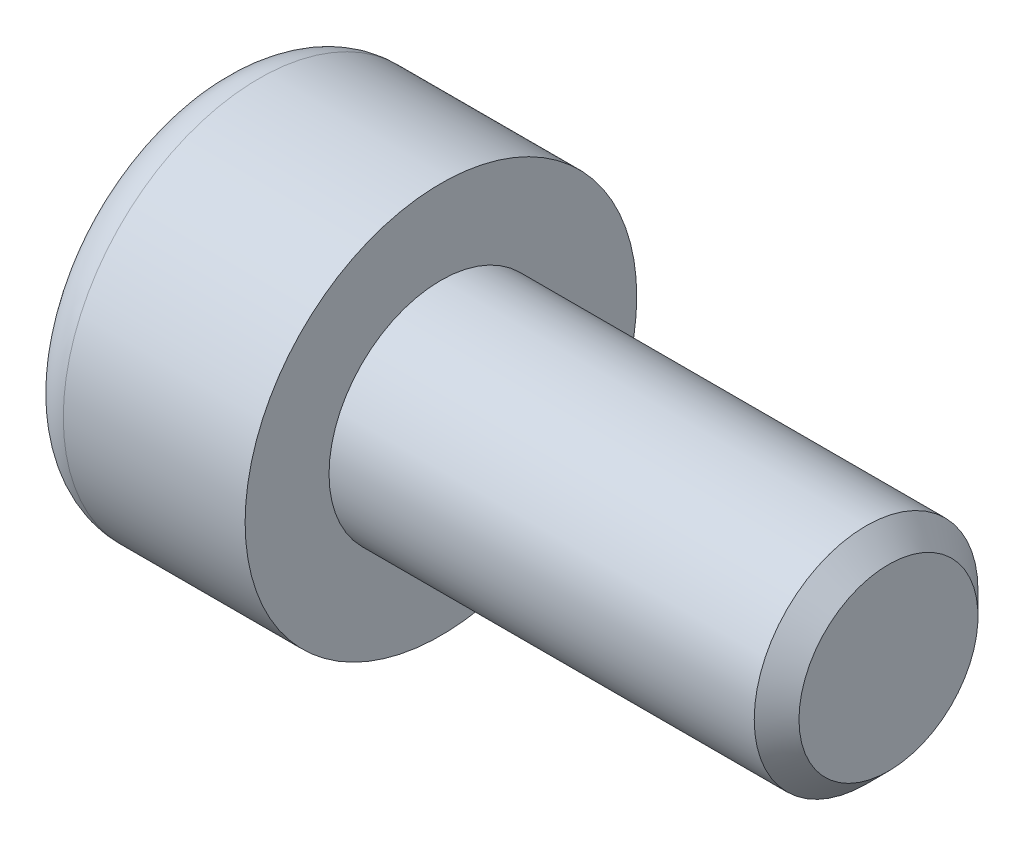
ISO-10303-21;
HEADER;
FILE_DESCRIPTION(('STEP AP214'),'2;1');
FILE_NAME('part.step','',(''),(''),'','','');
FILE_SCHEMA(('AUTOMOTIVE_DESIGN { 1 0 10303 214 1 1 1 1 }'));
ENDSEC;
DATA;
#1=APPLICATION_CONTEXT('core data for automotive mechanical design processes');
#2=APPLICATION_PROTOCOL_DEFINITION('international standard','automotive_design',2000,#1);
#3=PRODUCT_CONTEXT('',#1,'mechanical');
#4=PRODUCT('Part','Part','',(#3));
#5=PRODUCT_RELATED_PRODUCT_CATEGORY('part','',(#4));
#6=PRODUCT_DEFINITION_FORMATION('','',#4);
#7=PRODUCT_DEFINITION_CONTEXT('part definition',#1,'design');
#8=PRODUCT_DEFINITION('design','',#6,#7);
#9=PRODUCT_DEFINITION_SHAPE('','',#8);
#10=(LENGTH_UNIT() NAMED_UNIT(*) SI_UNIT(.MILLI.,.METRE.));
#11=(NAMED_UNIT(*) PLANE_ANGLE_UNIT() SI_UNIT($,.RADIAN.));
#12=(NAMED_UNIT(*) SI_UNIT($,.STERADIAN.) SOLID_ANGLE_UNIT());
#13=UNCERTAINTY_MEASURE_WITH_UNIT(LENGTH_MEASURE(1.E-05),#10,'distance_accuracy_value','');
#14=(GEOMETRIC_REPRESENTATION_CONTEXT(3) GLOBAL_UNCERTAINTY_ASSIGNED_CONTEXT((#13)) GLOBAL_UNIT_ASSIGNED_CONTEXT((#10,
#11,#12)) REPRESENTATION_CONTEXT('',''));
#15=CARTESIAN_POINT('',(0.,0.,0.));
#16=DIRECTION('',(0.,0.,1.));
#17=DIRECTION('',(1.,0.,0.));
#18=AXIS2_PLACEMENT_3D('',#15,#16,#17);
#19=CARTESIAN_POINT('',(8.,2.,0.));
#20=DIRECTION('',(-1.,0.,0.));
#21=DIRECTION('',(0.,0.,1.));
#22=AXIS2_PLACEMENT_3D('',#19,#20,#21);
#23=PLANE('',#22);
#24=CARTESIAN_POINT('',(8.,0.,0.));
#25=DIRECTION('',(-1.,0.,0.));
#26=DIRECTION('',(0.,0.,1.));
#27=AXIS2_PLACEMENT_3D('',#24,#25,#26);
#28=CIRCLE('',#27,1.6);
#29=CARTESIAN_POINT('',(8.,0.,1.6));
#30=VERTEX_POINT('',#29);
#31=EDGE_CURVE('E151',#30,#30,#28,.F.);
#32=ORIENTED_EDGE('',*,*,#31,.T.);
#33=EDGE_LOOP('',(#32));
#34=FACE_BOUND('',#33,.T.);
#35=ADVANCED_FACE('F34',(#34),#23,.F.);
#36=CARTESIAN_POINT('',(-28.9826848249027,0.,0.));
#37=DIRECTION('',(-1.,0.,0.));
#38=DIRECTION('',(0.,0.,1.));
#39=AXIS2_PLACEMENT_3D('',#36,#37,#38);
#40=CYLINDRICAL_SURFACE('',#39,2.);
#41=CARTESIAN_POINT('',(7.6,0.,0.));
#42=DIRECTION('',(-1.,0.,0.));
#43=DIRECTION('',(0.,0.,1.));
#44=AXIS2_PLACEMENT_3D('',#41,#42,#43);
#45=CIRCLE('',#44,2.);
#46=CARTESIAN_POINT('',(7.6,0.,2.));
#47=VERTEX_POINT('',#46);
#48=EDGE_CURVE('E148',#47,#47,#45,.T.);
#49=ORIENTED_EDGE('',*,*,#48,.T.);
#50=EDGE_LOOP('',(#49));
#51=FACE_BOUND('',#50,.T.);
#52=CARTESIAN_POINT('',(0.,0.,0.));
#53=DIRECTION('',(-1.,0.,0.));
#54=DIRECTION('',(0.,0.,1.));
#55=AXIS2_PLACEMENT_3D('',#52,#53,#54);
#56=CIRCLE('',#55,2.);
#57=CARTESIAN_POINT('',(0.,0.,2.));
#58=VERTEX_POINT('',#57);
#59=EDGE_CURVE('E145',#58,#58,#56,.T.);
#60=ORIENTED_EDGE('',*,*,#59,.F.);
#61=EDGE_LOOP('',(#60));
#62=FACE_BOUND('',#61,.T.);
#63=ADVANCED_FACE('F172',(#51,#62),#40,.T.);
#64=CARTESIAN_POINT('',(0.,3.5,0.));
#65=DIRECTION('',(-1.,0.,0.));
#66=DIRECTION('',(0.,0.,1.));
#67=AXIS2_PLACEMENT_3D('',#64,#65,#66);
#68=PLANE('',#67);
#69=CARTESIAN_POINT('',(0.,0.,0.));
#70=DIRECTION('',(-1.,0.,0.));
#71=DIRECTION('',(0.,0.,1.));
#72=AXIS2_PLACEMENT_3D('',#69,#70,#71);
#73=CIRCLE('',#72,3.5);
#74=CARTESIAN_POINT('',(0.,0.,3.5));
#75=VERTEX_POINT('',#74);
#76=EDGE_CURVE('E136',#75,#75,#73,.T.);
#77=ORIENTED_EDGE('',*,*,#76,.F.);
#78=EDGE_LOOP('',(#77));
#79=FACE_BOUND('',#78,.T.);
#80=ORIENTED_EDGE('',*,*,#59,.T.);
#81=EDGE_LOOP('',(#80));
#82=FACE_BOUND('',#81,.T.);
#83=ADVANCED_FACE('F177',(#79,#82),#68,.F.);
#84=CARTESIAN_POINT('',(-28.9826848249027,0.,0.));
#85=DIRECTION('',(-1.,0.,0.));
#86=DIRECTION('',(0.,0.,1.));
#87=AXIS2_PLACEMENT_3D('',#84,#85,#86);
#88=CYLINDRICAL_SURFACE('',#87,3.5);
#89=CARTESIAN_POINT('',(-3.25,0.,0.));
#90=DIRECTION('',(1.,0.,0.));
#91=DIRECTION('',(0.,0.,-1.));
#92=AXIS2_PLACEMENT_3D('',#89,#90,#91);
#93=CIRCLE('',#92,3.5);
#94=CARTESIAN_POINT('',(-3.25,0.,-3.5));
#95=VERTEX_POINT('',#94);
#96=EDGE_CURVE('E11',#95,#95,#93,.T.);
#97=ORIENTED_EDGE('',*,*,#96,.T.);
#98=EDGE_LOOP('',(#97));
#99=FACE_BOUND('',#98,.T.);
#100=ORIENTED_EDGE('',*,*,#76,.T.);
#101=EDGE_LOOP('',(#100));
#102=FACE_BOUND('',#101,.T.);
#103=ADVANCED_FACE('F186',(#99,#102),#88,.T.);
#104=CARTESIAN_POINT('',(-4.,0.,0.));
#105=DIRECTION('',(1.,0.,0.));
#106=DIRECTION('',(0.,0.,-1.));
#107=AXIS2_PLACEMENT_3D('',#104,#105,#106);
#108=PLANE('',#107);
#109=DIRECTION('',(0.,0.86602540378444,-0.499999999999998));
#110=VECTOR('',#109,1.);
#111=CARTESIAN_POINT('',(-4.,1.5,0.866025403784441));
#112=LINE('',#111,#110);
#113=CARTESIAN_POINT('',(-4.,0.,1.73205080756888));
#114=VERTEX_POINT('',#113);
#115=CARTESIAN_POINT('',(-4.,1.5,0.866025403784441));
#116=VERTEX_POINT('',#115);
#117=EDGE_CURVE('E102',#114,#116,#112,.T.);
#118=ORIENTED_EDGE('',*,*,#117,.F.);
#119=DIRECTION('',(0.,0.86602540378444,0.499999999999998));
#120=VECTOR('',#119,1.);
#121=CARTESIAN_POINT('',(-4.,0.,1.73205080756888));
#122=LINE('',#121,#120);
#123=CARTESIAN_POINT('',(-4.,-1.5,0.866025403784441));
#124=VERTEX_POINT('',#123);
#125=EDGE_CURVE('E48',#124,#114,#122,.T.);
#126=ORIENTED_EDGE('',*,*,#125,.F.);
#127=DIRECTION('',(0.,0.,1.));
#128=VECTOR('',#127,1.);
#129=CARTESIAN_POINT('',(-4.,-1.5,0.866025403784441));
#130=LINE('',#129,#128);
#131=CARTESIAN_POINT('',(-4.,-1.5,-0.86602540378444));
#132=VERTEX_POINT('',#131);
#133=EDGE_CURVE('E118',#132,#124,#130,.T.);
#134=ORIENTED_EDGE('',*,*,#133,.F.);
#135=DIRECTION('',(0.,-0.86602540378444,0.499999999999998));
#136=VECTOR('',#135,1.);
#137=CARTESIAN_POINT('',(-4.,-1.5,-0.86602540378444));
#138=LINE('',#137,#136);
#139=CARTESIAN_POINT('',(-4.,0.,-1.73205080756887));
#140=VERTEX_POINT('',#139);
#141=EDGE_CURVE('E112',#140,#132,#138,.T.);
#142=ORIENTED_EDGE('',*,*,#141,.F.);
#143=DIRECTION('',(0.,-0.86602540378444,-0.499999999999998));
#144=VECTOR('',#143,1.);
#145=CARTESIAN_POINT('',(-4.,0.,-1.73205080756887));
#146=LINE('',#145,#144);
#147=CARTESIAN_POINT('',(-4.,1.5,-0.866025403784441));
#148=VERTEX_POINT('',#147);
#149=EDGE_CURVE('E110',#148,#140,#146,.T.);
#150=ORIENTED_EDGE('',*,*,#149,.F.);
#151=DIRECTION('',(0.,0.,-1.));
#152=VECTOR('',#151,1.);
#153=CARTESIAN_POINT('',(-4.,1.5,-0.866025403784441));
#154=LINE('',#153,#152);
#155=EDGE_CURVE('E91',#116,#148,#154,.T.);
#156=ORIENTED_EDGE('',*,*,#155,.F.);
#157=EDGE_LOOP('',(#118,#126,#134,#142,#150,#156));
#158=FACE_BOUND('',#157,.T.);
#159=CARTESIAN_POINT('',(-4.,0.,0.));
#160=DIRECTION('',(1.,0.,0.));
#161=DIRECTION('',(0.,0.,-1.));
#162=AXIS2_PLACEMENT_3D('',#159,#160,#161);
#163=CIRCLE('',#162,2.75);
#164=CARTESIAN_POINT('',(-4.,0.,-2.75));
#165=VERTEX_POINT('',#164);
#166=EDGE_CURVE('E41',#165,#165,#163,.F.);
#167=ORIENTED_EDGE('',*,*,#166,.T.);
#168=EDGE_LOOP('',(#167));
#169=FACE_BOUND('',#168,.T.);
#170=ADVANCED_FACE('F106',(#158,#169),#108,.F.);
#171=CARTESIAN_POINT('',(7.6,0.,0.));
#172=DIRECTION('',(-1.,0.,0.));
#173=DIRECTION('',(0.,0.,1.));
#174=AXIS2_PLACEMENT_3D('',#171,#172,#173);
#175=CONICAL_SURFACE('',#174,2.,0.78539816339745);
#176=ORIENTED_EDGE('',*,*,#31,.F.);
#177=EDGE_LOOP('',(#176));
#178=FACE_BOUND('',#177,.T.);
#179=ORIENTED_EDGE('',*,*,#48,.F.);
#180=EDGE_LOOP('',(#179));
#181=FACE_BOUND('',#180,.T.);
#182=ADVANCED_FACE('F159',(#178,#181),#175,.T.);
#183=CARTESIAN_POINT('',(-3.25,0.,0.));
#184=DIRECTION('',(1.,0.,0.));
#185=DIRECTION('',(0.,0.,-1.));
#186=AXIS2_PLACEMENT_3D('',#183,#184,#185);
#187=TOROIDAL_SURFACE('',#186,2.75,0.75);
#188=ORIENTED_EDGE('',*,*,#96,.F.);
#189=EDGE_LOOP('',(#188));
#190=FACE_BOUND('',#189,.T.);
#191=ORIENTED_EDGE('',*,*,#166,.F.);
#192=EDGE_LOOP('',(#191));
#193=FACE_BOUND('',#192,.T.);
#194=ADVANCED_FACE('F156',(#190,#193),#187,.T.);
#195=CARTESIAN_POINT('',(-1.5,0.,1.73205080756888));
#196=DIRECTION('',(0.,-0.499999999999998,0.86602540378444));
#197=DIRECTION('',(0.,-0.86602540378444,-0.499999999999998));
#198=AXIS2_PLACEMENT_3D('',#195,#196,#197);
#199=PLANE('',#198);
#200=ORIENTED_EDGE('',*,*,#125,.T.);
#201=DIRECTION('',(-1.,0.,0.));
#202=VECTOR('',#201,1.);
#203=CARTESIAN_POINT('',(-1.5,0.,1.73205080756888));
#204=LINE('',#203,#202);
#205=CARTESIAN_POINT('',(-1.5,0.,1.73205080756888));
#206=VERTEX_POINT('',#205);
#207=EDGE_CURVE('E99',#206,#114,#204,.T.);
#208=ORIENTED_EDGE('',*,*,#207,.F.);
#209=DIRECTION('',(0.,0.86602540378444,0.499999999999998));
#210=VECTOR('',#209,1.);
#211=CARTESIAN_POINT('',(-1.5,0.,1.73205080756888));
#212=LINE('',#211,#210);
#213=CARTESIAN_POINT('',(-1.5,-1.5,0.866025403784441));
#214=VERTEX_POINT('',#213);
#215=EDGE_CURVE('E120',#214,#206,#212,.T.);
#216=ORIENTED_EDGE('',*,*,#215,.F.);
#217=DIRECTION('',(-1.,0.,0.));
#218=VECTOR('',#217,1.);
#219=CARTESIAN_POINT('',(-1.5,-1.5,0.866025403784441));
#220=LINE('',#219,#218);
#221=EDGE_CURVE('E55',#214,#124,#220,.T.);
#222=ORIENTED_EDGE('',*,*,#221,.T.);
#223=EDGE_LOOP('',(#200,#208,#216,#222));
#224=FACE_BOUND('',#223,.T.);
#225=ADVANCED_FACE('F158',(#224),#199,.F.);
#226=CARTESIAN_POINT('',(-1.5,-1.5,0.866025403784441));
#227=DIRECTION('',(0.,-1.,0.));
#228=DIRECTION('',(0.,0.,-1.));
#229=AXIS2_PLACEMENT_3D('',#226,#227,#228);
#230=PLANE('',#229);
#231=ORIENTED_EDGE('',*,*,#133,.T.);
#232=ORIENTED_EDGE('',*,*,#221,.F.);
#233=DIRECTION('',(0.,0.,1.));
#234=VECTOR('',#233,1.);
#235=CARTESIAN_POINT('',(-1.5,-1.5,0.866025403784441));
#236=LINE('',#235,#234);
#237=CARTESIAN_POINT('',(-1.5,-1.5,-0.86602540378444));
#238=VERTEX_POINT('',#237);
#239=EDGE_CURVE('E132',#238,#214,#236,.T.);
#240=ORIENTED_EDGE('',*,*,#239,.F.);
#241=DIRECTION('',(-1.,0.,0.));
#242=VECTOR('',#241,1.);
#243=CARTESIAN_POINT('',(-1.5,-1.5,-0.86602540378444));
#244=LINE('',#243,#242);
#245=EDGE_CURVE('E137',#238,#132,#244,.T.);
#246=ORIENTED_EDGE('',*,*,#245,.T.);
#247=EDGE_LOOP('',(#231,#232,#240,#246));
#248=FACE_BOUND('',#247,.T.);
#249=ADVANCED_FACE('F166',(#248),#230,.F.);
#250=CARTESIAN_POINT('',(-1.5,-1.5,-0.86602540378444));
#251=DIRECTION('',(0.,-0.499999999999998,-0.86602540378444));
#252=DIRECTION('',(0.,0.86602540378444,-0.499999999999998));
#253=AXIS2_PLACEMENT_3D('',#250,#251,#252);
#254=PLANE('',#253);
#255=ORIENTED_EDGE('',*,*,#141,.T.);
#256=ORIENTED_EDGE('',*,*,#245,.F.);
#257=DIRECTION('',(0.,-0.86602540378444,0.499999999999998));
#258=VECTOR('',#257,1.);
#259=CARTESIAN_POINT('',(-1.5,-1.5,-0.86602540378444));
#260=LINE('',#259,#258);
#261=CARTESIAN_POINT('',(-1.5,0.,-1.73205080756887));
#262=VERTEX_POINT('',#261);
#263=EDGE_CURVE('E129',#262,#238,#260,.T.);
#264=ORIENTED_EDGE('',*,*,#263,.F.);
#265=DIRECTION('',(-1.,0.,0.));
#266=VECTOR('',#265,1.);
#267=CARTESIAN_POINT('',(-1.5,0.,-1.73205080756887));
#268=LINE('',#267,#266);
#269=EDGE_CURVE('E139',#262,#140,#268,.T.);
#270=ORIENTED_EDGE('',*,*,#269,.T.);
#271=EDGE_LOOP('',(#255,#256,#264,#270));
#272=FACE_BOUND('',#271,.T.);
#273=ADVANCED_FACE('F232',(#272),#254,.F.);
#274=CARTESIAN_POINT('',(-1.5,0.,-1.73205080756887));
#275=DIRECTION('',(0.,0.499999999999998,-0.86602540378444));
#276=DIRECTION('',(0.,0.86602540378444,0.499999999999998));
#277=AXIS2_PLACEMENT_3D('',#274,#275,#276);
#278=PLANE('',#277);
#279=ORIENTED_EDGE('',*,*,#149,.T.);
#280=ORIENTED_EDGE('',*,*,#269,.F.);
#281=DIRECTION('',(0.,-0.86602540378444,-0.499999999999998));
#282=VECTOR('',#281,1.);
#283=CARTESIAN_POINT('',(-1.5,0.,-1.73205080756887));
#284=LINE('',#283,#282);
#285=CARTESIAN_POINT('',(-1.5,1.5,-0.866025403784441));
#286=VERTEX_POINT('',#285);
#287=EDGE_CURVE('E126',#286,#262,#284,.T.);
#288=ORIENTED_EDGE('',*,*,#287,.F.);
#289=DIRECTION('',(-1.,0.,0.));
#290=VECTOR('',#289,1.);
#291=CARTESIAN_POINT('',(-1.5,1.5,-0.866025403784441));
#292=LINE('',#291,#290);
#293=EDGE_CURVE('E98',#286,#148,#292,.T.);
#294=ORIENTED_EDGE('',*,*,#293,.T.);
#295=EDGE_LOOP('',(#279,#280,#288,#294));
#296=FACE_BOUND('',#295,.T.);
#297=ADVANCED_FACE('F240',(#296),#278,.F.);
#298=CARTESIAN_POINT('',(-1.5,1.5,-0.866025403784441));
#299=DIRECTION('',(0.,1.,0.));
#300=DIRECTION('',(0.,0.,1.));
#301=AXIS2_PLACEMENT_3D('',#298,#299,#300);
#302=PLANE('',#301);
#303=ORIENTED_EDGE('',*,*,#155,.T.);
#304=ORIENTED_EDGE('',*,*,#293,.F.);
#305=DIRECTION('',(0.,0.,-1.));
#306=VECTOR('',#305,1.);
#307=CARTESIAN_POINT('',(-1.5,1.5,-0.866025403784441));
#308=LINE('',#307,#306);
#309=CARTESIAN_POINT('',(-1.5,1.5,0.866025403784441));
#310=VERTEX_POINT('',#309);
#311=EDGE_CURVE('E94',#310,#286,#308,.T.);
#312=ORIENTED_EDGE('',*,*,#311,.F.);
#313=DIRECTION('',(-1.,0.,0.));
#314=VECTOR('',#313,1.);
#315=CARTESIAN_POINT('',(-1.5,1.5,0.866025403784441));
#316=LINE('',#315,#314);
#317=EDGE_CURVE('E87',#310,#116,#316,.T.);
#318=ORIENTED_EDGE('',*,*,#317,.T.);
#319=EDGE_LOOP('',(#303,#304,#312,#318));
#320=FACE_BOUND('',#319,.T.);
#321=ADVANCED_FACE('F89',(#320),#302,.F.);
#322=CARTESIAN_POINT('',(-1.5,1.5,0.866025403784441));
#323=DIRECTION('',(0.,0.499999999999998,0.86602540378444));
#324=DIRECTION('',(0.,-0.86602540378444,0.499999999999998));
#325=AXIS2_PLACEMENT_3D('',#322,#323,#324);
#326=PLANE('',#325);
#327=ORIENTED_EDGE('',*,*,#117,.T.);
#328=ORIENTED_EDGE('',*,*,#317,.F.);
#329=DIRECTION('',(0.,0.86602540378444,-0.499999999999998));
#330=VECTOR('',#329,1.);
#331=CARTESIAN_POINT('',(-1.5,1.5,0.866025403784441));
#332=LINE('',#331,#330);
#333=EDGE_CURVE('E123',#206,#310,#332,.T.);
#334=ORIENTED_EDGE('',*,*,#333,.F.);
#335=ORIENTED_EDGE('',*,*,#207,.T.);
#336=EDGE_LOOP('',(#327,#328,#334,#335));
#337=FACE_BOUND('',#336,.T.);
#338=ADVANCED_FACE('F103',(#337),#326,.F.);
#339=CARTESIAN_POINT('',(-1.5,-1.5,0.866025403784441));
#340=DIRECTION('',(1.,0.,0.));
#341=DIRECTION('',(0.,0.,-1.));
#342=AXIS2_PLACEMENT_3D('',#339,#340,#341);
#343=PLANE('',#342);
#344=ORIENTED_EDGE('',*,*,#215,.T.);
#345=ORIENTED_EDGE('',*,*,#333,.T.);
#346=ORIENTED_EDGE('',*,*,#311,.T.);
#347=ORIENTED_EDGE('',*,*,#287,.T.);
#348=ORIENTED_EDGE('',*,*,#263,.T.);
#349=ORIENTED_EDGE('',*,*,#239,.T.);
#350=EDGE_LOOP('',(#344,#345,#346,#347,#348,#349));
#351=FACE_BOUND('',#350,.T.);
#352=ADVANCED_FACE('F264',(#351),#343,.F.);
#353=CLOSED_SHELL('',(#35,#63,#83,#103,#170,#182,#194,#225,#249,#273,#297,#321,#338,#352));
#354=MANIFOLD_SOLID_BREP('B2',#353);
#355=ADVANCED_BREP_SHAPE_REPRESENTATION('',(#18,#354),#14);
#356=SHAPE_DEFINITION_REPRESENTATION(#9,#355);
ENDSEC;
END-ISO-10303-21;
